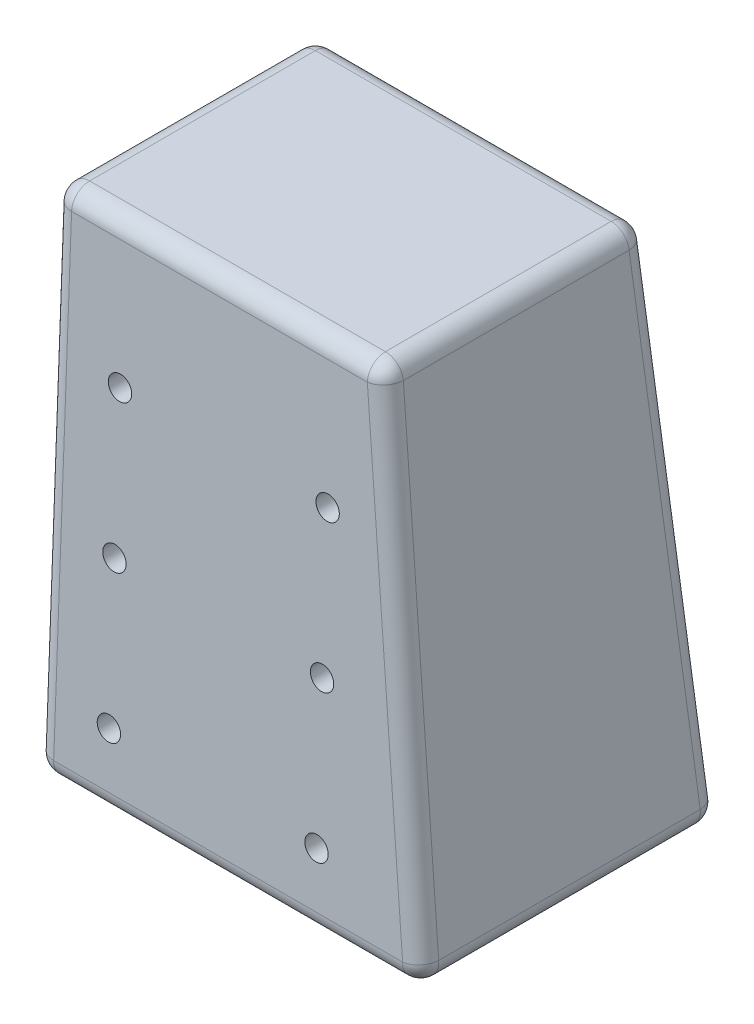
from build123d import *

# Parameters (mm, degrees)
FILLET1_R               = 2.5
SKETCH6_W               = 20.6
SKETCH6_H               = 60.584581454
CUT_EXTRUDE2_DEPTH      = 42
CUT_EXTRUDE4_DEPTH      = 91.91614264
CUT_EXTRUDE4_DEPTH_BACK = 91.91614264
SKETCH10_R              = 1.612531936


with BuildPart() as part:
    # Sketch1 → Loft1 section 0
    with BuildSketch(Plane(origin=(0, 0, 0), x_dir=(1, 0, 0), z_dir=(0, 1, 0))):
        with BuildLine():
            Line((0, 20.678978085), (53.540697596, 20.678978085))
            Line((53.540697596, 20.678978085), (53.540697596, -20.678978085))
            Line((53.540697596, -20.678978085), (0, -20.678978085))
            Line((0, -20.678978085), (0, 20.678978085))
        make_face()
    # Sketch3 → Loft1 section 1
    with BuildSketch(Plane(origin=(0, 69.515554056, 0), x_dir=(1, 0, 0), z_dir=(0, 1, 0))):
        with BuildLine():
            Line((45.618315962, 18.008613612), (45.618315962, -18.008613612))
            Line((45.618315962, -18.008613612), (0, -18.008613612))
            Line((0, -18.008613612), (0, 18.008613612))
            Line((0, 18.008613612), (45.618315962, 18.008613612))
        make_face()
    loft()

    # Fillet1
    fillet1_edges = [part.edges().sort_by_distance(p)[0] for p in [
        (26.770348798, 0, 20.678978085),
        (22.809157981, 69.515554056, 18.008613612),
        (0, 69.515554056, 0),
        (22.809157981, 69.515554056, -18.008613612),
        (45.618315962, 69.515554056, 0),
        (0, 0, 0),
        (26.770348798, 0, -20.678978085),
        (53.540697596, 0, 0),
        (49.579506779, 34.757777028, 19.343795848),
        (0, 34.757777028, 19.343795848),
        (49.579506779, 34.757777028, -19.343795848),
        (0, 34.757777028, -19.343795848),
    ]]
    fillet(fillet1_edges, radius=FILLET1_R)

    # Sketch6 → Cut-Extrude2 (cut)
    with BuildSketch(Plane.ZY):
        with Locations((0, 30.292290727)):
            Rectangle(SKETCH6_W, SKETCH6_H)
    extrude(amount=-CUT_EXTRUDE2_DEPTH, mode=Mode.SUBTRACT)

    # Sketch10 → Cut-Extrude4 (cut, two sides: drawn at the far end of the back side and taken through both)
    with BuildSketch(Plane(origin=(0, 0, -3.890876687), x_dir=(-1, 0, 0), z_dir=(0, 0, -1)).offset(-CUT_EXTRUDE4_DEPTH_BACK)):
        with Locations(Location((-38.554678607, 30.001350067, 0), (0, 0, 90))):
            Circle(SKETCH10_R)
        with Locations(Location((-38.554678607, 10.000387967, 0), (0, 0, 90))):
            Circle(SKETCH10_R)
        with Locations(Location((-38.554678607, 50, 0), (0, 0, 90))):
            Circle(SKETCH10_R)
        with Locations(Location((-9.851610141, 50, 0), (0, 0, 90))):
            Circle(SKETCH10_R)
        with Locations(Location((-9.851610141, 30.001350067, 0), (0, 0, 90))):
            Circle(SKETCH10_R)
        with Locations(Location((-9.851610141, 10.000387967, 0), (0, 0, 90))):
            Circle(SKETCH10_R)
    extrude(amount=CUT_EXTRUDE4_DEPTH + CUT_EXTRUDE4_DEPTH_BACK, mode=Mode.SUBTRACT)


solid = part.part
